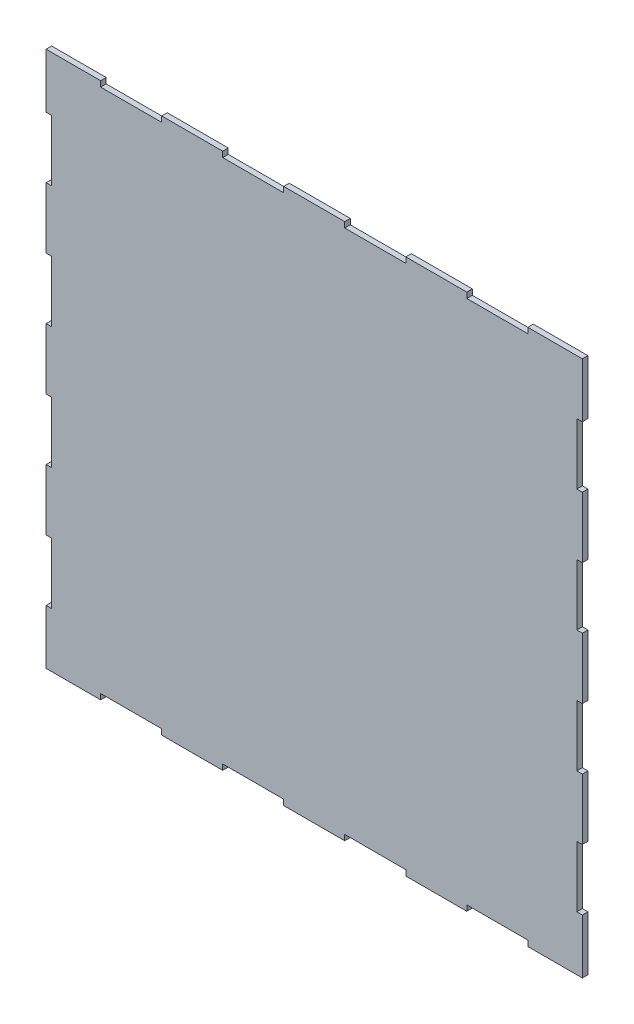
from build123d import *

# Parameters (mm, degrees)
BOSS_EXTRUDE1_DEPTH = 3


with BuildPart() as part:
    # Sketch1 → Boss-Extrude1 (new body)
    with BuildSketch(Plane.XY):
        Polygon((0, 293), (0, 263.5), (3, 263.5), (3, 230.5), (0, 230.5), (0, 197.5), (3, 197.5), (3, 164.5), (0, 164.5), (0, 131.5), (3, 131.5), (3, 98.5), (0, 98.5), (0, 65.5), (3, 65.5), (3, 32.5), (0, 32.5), (0, 3), (29.5, 3), (29.5, 6), (62.5, 6), (62.5, 3), (95.5, 3), (95.5, 6), (128.5, 6), (128.5, 3), (161.5, 3), (161.5, 6), (194.5, 6), (194.5, 3), (227.5, 3), (227.5, 6), (260.5, 6), (260.5, 3), (290, 3), (290, 32.5), (287, 32.5), (287, 65.5), (290, 65.5), (290, 98.5), (287, 98.5), (287, 131.5), (290, 131.5), (290, 164.5), (287, 164.5), (287, 197.5), (290, 197.5), (290, 230.5), (287, 230.5), (287, 263.5), (290, 263.5), (290, 293), (260.5, 293), (260.5, 290), (227.5, 290), (227.5, 293), (194.5, 293), (194.5, 290), (161.5, 290), (161.5, 293), (128.5, 293), (128.5, 290), (95.5, 290), (95.5, 293), (62.5, 293), (62.5, 290), (29.5, 290), (29.5, 293), align=None)
    extrude(amount=BOSS_EXTRUDE1_DEPTH)


solid = part.part
